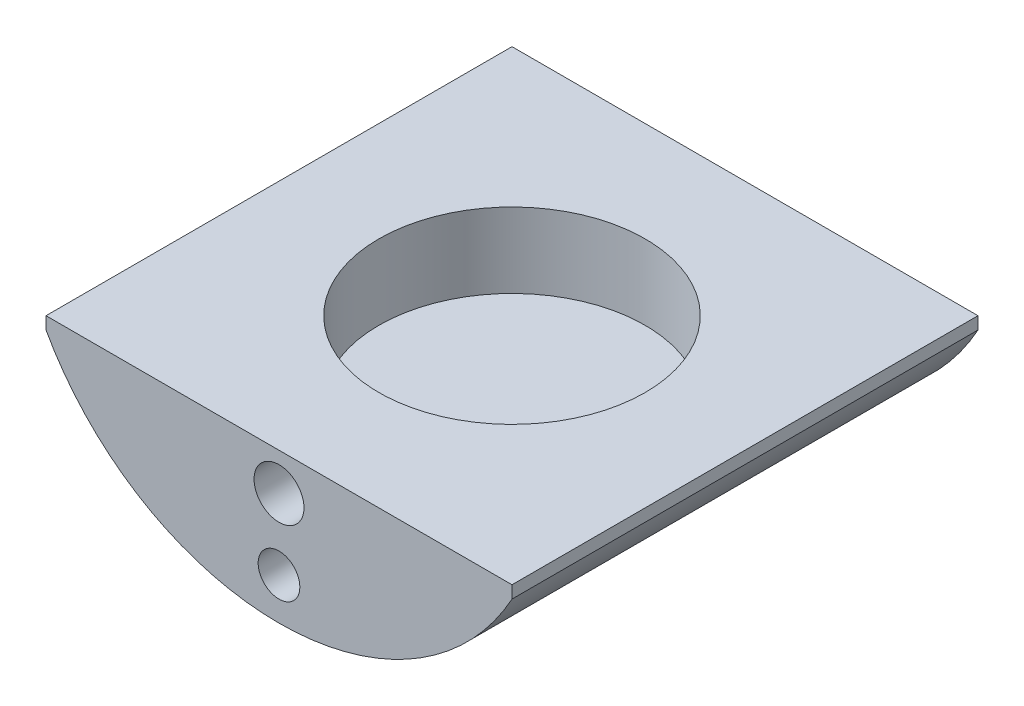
ISO-10303-21;
HEADER;
FILE_DESCRIPTION(('STEP AP214'),'2;1');
FILE_NAME('part.step','',(''),(''),'','','');
FILE_SCHEMA(('AUTOMOTIVE_DESIGN { 1 0 10303 214 1 1 1 1 }'));
ENDSEC;
DATA;
#1=APPLICATION_CONTEXT('core data for automotive mechanical design processes');
#2=APPLICATION_PROTOCOL_DEFINITION('international standard','automotive_design',2000,#1);
#3=PRODUCT_CONTEXT('',#1,'mechanical');
#4=PRODUCT('Part','Part','',(#3));
#5=PRODUCT_RELATED_PRODUCT_CATEGORY('part','',(#4));
#6=PRODUCT_DEFINITION_FORMATION('','',#4);
#7=PRODUCT_DEFINITION_CONTEXT('part definition',#1,'design');
#8=PRODUCT_DEFINITION('design','',#6,#7);
#9=PRODUCT_DEFINITION_SHAPE('','',#8);
#10=(LENGTH_UNIT() NAMED_UNIT(*) SI_UNIT(.MILLI.,.METRE.));
#11=(NAMED_UNIT(*) PLANE_ANGLE_UNIT() SI_UNIT($,.RADIAN.));
#12=(NAMED_UNIT(*) SI_UNIT($,.STERADIAN.) SOLID_ANGLE_UNIT());
#13=UNCERTAINTY_MEASURE_WITH_UNIT(LENGTH_MEASURE(1.E-05),#10,'distance_accuracy_value','');
#14=(GEOMETRIC_REPRESENTATION_CONTEXT(3) GLOBAL_UNCERTAINTY_ASSIGNED_CONTEXT((#13)) GLOBAL_UNIT_ASSIGNED_CONTEXT((#10,
#11,#12)) REPRESENTATION_CONTEXT('',''));
#15=CARTESIAN_POINT('',(0.,0.,0.));
#16=DIRECTION('',(0.,0.,1.));
#17=DIRECTION('',(1.,0.,0.));
#18=AXIS2_PLACEMENT_3D('',#15,#16,#17);
#19=CARTESIAN_POINT('',(0.,22.225,-44.45));
#20=DIRECTION('',(0.,0.,1.));
#21=DIRECTION('',(1.,0.,0.));
#22=AXIS2_PLACEMENT_3D('',#19,#20,#21);
#23=PLANE('',#22);
#24=CARTESIAN_POINT('',(0.,-7.14375,-44.45));
#25=DIRECTION('',(0.,0.,1.));
#26=DIRECTION('',(1.,0.,0.));
#27=AXIS2_PLACEMENT_3D('',#24,#25,#26);
#28=CIRCLE('',#27,4.7625);
#29=CARTESIAN_POINT('',(4.7625,-7.14375,-44.45));
#30=VERTEX_POINT('',#29);
#31=EDGE_CURVE('E119',#30,#30,#28,.T.);
#32=ORIENTED_EDGE('',*,*,#31,.T.);
#33=EDGE_LOOP('',(#32));
#34=FACE_BOUND('',#33,.T.);
#35=DIRECTION('',(0.,-1.,0.));
#36=VECTOR('',#35,1.);
#37=CARTESIAN_POINT('',(-44.45,0.,-44.45));
#38=LINE('',#37,#36);
#39=CARTESIAN_POINT('',(-44.45,0.,-44.45));
#40=VERTEX_POINT('',#39);
#41=CARTESIAN_POINT('',(-44.45,-2.36844424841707,-44.45));
#42=VERTEX_POINT('',#41);
#43=EDGE_CURVE('E71',#40,#42,#38,.T.);
#44=ORIENTED_EDGE('',*,*,#43,.F.);
#45=DIRECTION('',(1.,0.,0.));
#46=VECTOR('',#45,1.);
#47=CARTESIAN_POINT('',(-44.45,0.,-44.45));
#48=LINE('',#47,#46);
#49=CARTESIAN_POINT('',(44.45,0.,-44.45));
#50=VERTEX_POINT('',#49);
#51=EDGE_CURVE('E50',#40,#50,#48,.T.);
#52=ORIENTED_EDGE('',*,*,#51,.T.);
#53=DIRECTION('',(0.,1.,0.));
#54=VECTOR('',#53,1.);
#55=CARTESIAN_POINT('',(44.45,-2.3684442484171,-44.45));
#56=LINE('',#55,#54);
#57=CARTESIAN_POINT('',(44.45,-2.3684442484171,-44.45));
#58=VERTEX_POINT('',#57);
#59=EDGE_CURVE('E100',#58,#50,#56,.T.);
#60=ORIENTED_EDGE('',*,*,#59,.F.);
#61=CARTESIAN_POINT('',(0.,22.225,-44.45));
#62=DIRECTION('',(0.,0.,1.));
#63=DIRECTION('',(1.,0.,0.));
#64=AXIS2_PLACEMENT_3D('',#61,#62,#63);
#65=CIRCLE('',#64,50.8);
#66=EDGE_CURVE('E98',#42,#58,#65,.T.);
#67=ORIENTED_EDGE('',*,*,#66,.F.);
#68=EDGE_LOOP('',(#44,#52,#60,#67));
#69=FACE_BOUND('',#68,.T.);
#70=CARTESIAN_POINT('',(0.,-20.6248,-44.4500000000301));
#71=DIRECTION('',(0.,0.,1.));
#72=DIRECTION('',(1.,0.,0.));
#73=AXIS2_PLACEMENT_3D('',#70,#71,#72);
#74=CIRCLE('',#73,3.9751);
#75=CARTESIAN_POINT('',(3.9751,-20.6248,-44.4500000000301));
#76=VERTEX_POINT('',#75);
#77=EDGE_CURVE('E114',#76,#76,#74,.T.);
#78=ORIENTED_EDGE('',*,*,#77,.T.);
#79=EDGE_LOOP('',(#78));
#80=FACE_BOUND('',#79,.T.);
#81=ADVANCED_FACE('F28',(#34,#69,#80),#23,.F.);
#82=CARTESIAN_POINT('',(-44.45,0.,-44.45));
#83=DIRECTION('',(-1.,0.,0.));
#84=DIRECTION('',(0.,-1.,0.));
#85=AXIS2_PLACEMENT_3D('',#82,#83,#84);
#86=PLANE('',#85);
#87=DIRECTION('',(0.,-1.,0.));
#88=VECTOR('',#87,1.);
#89=CARTESIAN_POINT('',(-44.45,0.,44.45));
#90=LINE('',#89,#88);
#91=CARTESIAN_POINT('',(-44.45,0.,44.45));
#92=VERTEX_POINT('',#91);
#93=CARTESIAN_POINT('',(-44.45,-2.36844424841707,44.45));
#94=VERTEX_POINT('',#93);
#95=EDGE_CURVE('E70',#92,#94,#90,.T.);
#96=ORIENTED_EDGE('',*,*,#95,.F.);
#97=DIRECTION('',(0.,0.,1.));
#98=VECTOR('',#97,1.);
#99=CARTESIAN_POINT('',(-44.45,0.,-44.45));
#100=LINE('',#99,#98);
#101=EDGE_CURVE('E11',#40,#92,#100,.T.);
#102=ORIENTED_EDGE('',*,*,#101,.F.);
#103=ORIENTED_EDGE('',*,*,#43,.T.);
#104=DIRECTION('',(0.,0.,1.));
#105=VECTOR('',#104,1.);
#106=CARTESIAN_POINT('',(-44.45,-2.36844424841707,-44.45));
#107=LINE('',#106,#105);
#108=EDGE_CURVE('E32',#42,#94,#107,.T.);
#109=ORIENTED_EDGE('',*,*,#108,.T.);
#110=EDGE_LOOP('',(#96,#102,#103,#109));
#111=FACE_BOUND('',#110,.T.);
#112=ADVANCED_FACE('F30',(#111),#86,.T.);
#113=CARTESIAN_POINT('',(-44.45,0.,-44.45));
#114=DIRECTION('',(0.,-1.,0.));
#115=DIRECTION('',(1.,0.,0.));
#116=AXIS2_PLACEMENT_3D('',#113,#114,#115);
#117=PLANE('',#116);
#118=CARTESIAN_POINT('',(0.,0.,0.));
#119=DIRECTION('',(0.,1.,0.));
#120=DIRECTION('',(-1.,0.,0.));
#121=AXIS2_PLACEMENT_3D('',#118,#119,#120);
#122=CIRCLE('',#121,25.4);
#123=CARTESIAN_POINT('',(-25.4,0.,0.));
#124=VERTEX_POINT('',#123);
#125=EDGE_CURVE('E91',#124,#124,#122,.T.);
#126=ORIENTED_EDGE('',*,*,#125,.F.);
#127=EDGE_LOOP('',(#126));
#128=FACE_BOUND('',#127,.T.);
#129=DIRECTION('',(1.,0.,0.));
#130=VECTOR('',#129,1.);
#131=CARTESIAN_POINT('',(-44.45,0.,44.45));
#132=LINE('',#131,#130);
#133=CARTESIAN_POINT('',(44.45,0.,44.45));
#134=VERTEX_POINT('',#133);
#135=EDGE_CURVE('E87',#92,#134,#132,.T.);
#136=ORIENTED_EDGE('',*,*,#135,.T.);
#137=DIRECTION('',(0.,0.,1.));
#138=VECTOR('',#137,1.);
#139=CARTESIAN_POINT('',(44.45,0.,-44.45));
#140=LINE('',#139,#138);
#141=EDGE_CURVE('E37',#50,#134,#140,.T.);
#142=ORIENTED_EDGE('',*,*,#141,.F.);
#143=ORIENTED_EDGE('',*,*,#51,.F.);
#144=ORIENTED_EDGE('',*,*,#101,.T.);
#145=EDGE_LOOP('',(#136,#142,#143,#144));
#146=FACE_BOUND('',#145,.T.);
#147=ADVANCED_FACE('F107',(#128,#146),#117,.F.);
#148=CARTESIAN_POINT('',(44.45,-2.3684442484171,-44.45));
#149=DIRECTION('',(1.,0.,0.));
#150=DIRECTION('',(0.,1.,0.));
#151=AXIS2_PLACEMENT_3D('',#148,#149,#150);
#152=PLANE('',#151);
#153=DIRECTION('',(0.,1.,0.));
#154=VECTOR('',#153,1.);
#155=CARTESIAN_POINT('',(44.45,-2.3684442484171,44.45));
#156=LINE('',#155,#154);
#157=CARTESIAN_POINT('',(44.45,-2.3684442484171,44.45));
#158=VERTEX_POINT('',#157);
#159=EDGE_CURVE('E82',#158,#134,#156,.T.);
#160=ORIENTED_EDGE('',*,*,#159,.F.);
#161=DIRECTION('',(0.,0.,1.));
#162=VECTOR('',#161,1.);
#163=CARTESIAN_POINT('',(44.45,-2.3684442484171,-44.45));
#164=LINE('',#163,#162);
#165=EDGE_CURVE('E75',#58,#158,#164,.T.);
#166=ORIENTED_EDGE('',*,*,#165,.F.);
#167=ORIENTED_EDGE('',*,*,#59,.T.);
#168=ORIENTED_EDGE('',*,*,#141,.T.);
#169=EDGE_LOOP('',(#160,#166,#167,#168));
#170=FACE_BOUND('',#169,.T.);
#171=ADVANCED_FACE('F105',(#170),#152,.T.);
#172=CARTESIAN_POINT('',(0.,22.225,-44.45));
#173=DIRECTION('',(0.,0.,1.));
#174=DIRECTION('',(1.,0.,0.));
#175=AXIS2_PLACEMENT_3D('',#172,#173,#174);
#176=CYLINDRICAL_SURFACE('',#175,50.8);
#177=CARTESIAN_POINT('',(0.,22.225,44.45));
#178=DIRECTION('',(0.,0.,1.));
#179=DIRECTION('',(1.,0.,0.));
#180=AXIS2_PLACEMENT_3D('',#177,#178,#179);
#181=CIRCLE('',#180,50.8);
#182=EDGE_CURVE('E77',#94,#158,#181,.T.);
#183=ORIENTED_EDGE('',*,*,#182,.F.);
#184=ORIENTED_EDGE('',*,*,#108,.F.);
#185=ORIENTED_EDGE('',*,*,#66,.T.);
#186=ORIENTED_EDGE('',*,*,#165,.T.);
#187=EDGE_LOOP('',(#183,#184,#185,#186));
#188=FACE_BOUND('',#187,.T.);
#189=ADVANCED_FACE('F78',(#188),#176,.T.);
#190=CARTESIAN_POINT('',(0.,22.225,44.45));
#191=DIRECTION('',(0.,0.,1.));
#192=DIRECTION('',(1.,0.,0.));
#193=AXIS2_PLACEMENT_3D('',#190,#191,#192);
#194=PLANE('',#193);
#195=CARTESIAN_POINT('',(0.,-20.6248,44.4500000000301));
#196=DIRECTION('',(0.,0.,1.));
#197=DIRECTION('',(1.,0.,0.));
#198=AXIS2_PLACEMENT_3D('',#195,#196,#197);
#199=CIRCLE('',#198,3.9751);
#200=CARTESIAN_POINT('',(3.9751,-20.6248,44.4500000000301));
#201=VERTEX_POINT('',#200);
#202=EDGE_CURVE('E127',#201,#201,#199,.T.);
#203=ORIENTED_EDGE('',*,*,#202,.F.);
#204=EDGE_LOOP('',(#203));
#205=FACE_BOUND('',#204,.T.);
#206=CARTESIAN_POINT('',(0.,-7.14375,44.45));
#207=DIRECTION('',(0.,0.,1.));
#208=DIRECTION('',(1.,0.,0.));
#209=AXIS2_PLACEMENT_3D('',#206,#207,#208);
#210=CIRCLE('',#209,4.7625);
#211=CARTESIAN_POINT('',(4.7625,-7.14375,44.45));
#212=VERTEX_POINT('',#211);
#213=EDGE_CURVE('E133',#212,#212,#210,.T.);
#214=ORIENTED_EDGE('',*,*,#213,.F.);
#215=EDGE_LOOP('',(#214));
#216=FACE_BOUND('',#215,.T.);
#217=ORIENTED_EDGE('',*,*,#95,.T.);
#218=ORIENTED_EDGE('',*,*,#182,.T.);
#219=ORIENTED_EDGE('',*,*,#159,.T.);
#220=ORIENTED_EDGE('',*,*,#135,.F.);
#221=EDGE_LOOP('',(#217,#218,#219,#220));
#222=FACE_BOUND('',#221,.T.);
#223=ADVANCED_FACE('F85',(#205,#216,#222),#194,.T.);
#224=CARTESIAN_POINT('',(0.,-14.2875,0.));
#225=DIRECTION('',(0.,1.,0.));
#226=DIRECTION('',(-1.,0.,0.));
#227=AXIS2_PLACEMENT_3D('',#224,#225,#226);
#228=CYLINDRICAL_SURFACE('',#227,25.4);
#229=CARTESIAN_POINT('',(0.,-14.2875,0.));
#230=DIRECTION('',(0.,1.,0.));
#231=DIRECTION('',(-1.,0.,0.));
#232=AXIS2_PLACEMENT_3D('',#229,#230,#231);
#233=CIRCLE('',#232,25.4);
#234=CARTESIAN_POINT('',(-25.4,-14.2875,0.));
#235=VERTEX_POINT('',#234);
#236=EDGE_CURVE('E88',#235,#235,#233,.T.);
#237=ORIENTED_EDGE('',*,*,#236,.F.);
#238=EDGE_LOOP('',(#237));
#239=FACE_BOUND('',#238,.T.);
#240=ORIENTED_EDGE('',*,*,#125,.T.);
#241=EDGE_LOOP('',(#240));
#242=FACE_BOUND('',#241,.T.);
#243=ADVANCED_FACE('F141',(#239,#242),#228,.F.);
#244=CARTESIAN_POINT('',(0.,-14.2875,0.));
#245=DIRECTION('',(0.,1.,0.));
#246=DIRECTION('',(-1.,0.,0.));
#247=AXIS2_PLACEMENT_3D('',#244,#245,#246);
#248=PLANE('',#247);
#249=ORIENTED_EDGE('',*,*,#236,.T.);
#250=EDGE_LOOP('',(#249));
#251=FACE_BOUND('',#250,.T.);
#252=ADVANCED_FACE('F161',(#251),#248,.T.);
#253=CARTESIAN_POINT('',(0.,-7.14375,30.1625));
#254=DIRECTION('',(0.,0.,1.));
#255=DIRECTION('',(1.,0.,0.));
#256=AXIS2_PLACEMENT_3D('',#253,#254,#255);
#257=CYLINDRICAL_SURFACE('',#256,4.7625);
#258=CARTESIAN_POINT('',(0.,-7.14375,30.1625));
#259=DIRECTION('',(0.,0.,1.));
#260=DIRECTION('',(1.,0.,0.));
#261=AXIS2_PLACEMENT_3D('',#258,#259,#260);
#262=CIRCLE('',#261,4.7625);
#263=CARTESIAN_POINT('',(4.7625,-7.14375,30.1625));
#264=VERTEX_POINT('',#263);
#265=EDGE_CURVE('E136',#264,#264,#262,.T.);
#266=ORIENTED_EDGE('',*,*,#265,.F.);
#267=EDGE_LOOP('',(#266));
#268=FACE_BOUND('',#267,.T.);
#269=ORIENTED_EDGE('',*,*,#213,.T.);
#270=EDGE_LOOP('',(#269));
#271=FACE_BOUND('',#270,.T.);
#272=ADVANCED_FACE('F169',(#268,#271),#257,.F.);
#273=CARTESIAN_POINT('',(0.,-7.14375,30.1625));
#274=DIRECTION('',(0.,0.,1.));
#275=DIRECTION('',(1.,0.,0.));
#276=AXIS2_PLACEMENT_3D('',#273,#274,#275);
#277=PLANE('',#276);
#278=ORIENTED_EDGE('',*,*,#265,.T.);
#279=EDGE_LOOP('',(#278));
#280=FACE_BOUND('',#279,.T.);
#281=ADVANCED_FACE('F173',(#280),#277,.T.);
#282=CARTESIAN_POINT('',(0.,-20.6248,26.9875000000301));
#283=DIRECTION('',(0.,0.,1.));
#284=DIRECTION('',(1.,0.,0.));
#285=AXIS2_PLACEMENT_3D('',#282,#283,#284);
#286=CYLINDRICAL_SURFACE('',#285,3.9751);
#287=CARTESIAN_POINT('',(0.,-20.6248,26.9875000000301));
#288=DIRECTION('',(0.,0.,1.));
#289=DIRECTION('',(1.,0.,0.));
#290=AXIS2_PLACEMENT_3D('',#287,#288,#289);
#291=CIRCLE('',#290,3.9751);
#292=CARTESIAN_POINT('',(3.9751,-20.6248,26.9875000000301));
#293=VERTEX_POINT('',#292);
#294=EDGE_CURVE('E130',#293,#293,#291,.T.);
#295=ORIENTED_EDGE('',*,*,#294,.F.);
#296=EDGE_LOOP('',(#295));
#297=FACE_BOUND('',#296,.T.);
#298=ORIENTED_EDGE('',*,*,#202,.T.);
#299=EDGE_LOOP('',(#298));
#300=FACE_BOUND('',#299,.T.);
#301=ADVANCED_FACE('F176',(#297,#300),#286,.F.);
#302=CARTESIAN_POINT('',(0.,-20.6248,26.9875000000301));
#303=DIRECTION('',(0.,0.,1.));
#304=DIRECTION('',(1.,0.,0.));
#305=AXIS2_PLACEMENT_3D('',#302,#303,#304);
#306=PLANE('',#305);
#307=ORIENTED_EDGE('',*,*,#294,.T.);
#308=EDGE_LOOP('',(#307));
#309=FACE_BOUND('',#308,.T.);
#310=ADVANCED_FACE('F179',(#309),#306,.T.);
#311=CARTESIAN_POINT('',(0.,-7.14375,-30.1625));
#312=DIRECTION('',(0.,0.,-1.));
#313=DIRECTION('',(-1.,0.,0.));
#314=AXIS2_PLACEMENT_3D('',#311,#312,#313);
#315=CYLINDRICAL_SURFACE('',#314,4.7625);
#316=CARTESIAN_POINT('',(0.,-7.14375,-30.1625));
#317=DIRECTION('',(0.,0.,1.));
#318=DIRECTION('',(1.,0.,0.));
#319=AXIS2_PLACEMENT_3D('',#316,#317,#318);
#320=CIRCLE('',#319,4.7625);
#321=CARTESIAN_POINT('',(4.7625,-7.14375,-30.1625));
#322=VERTEX_POINT('',#321);
#323=EDGE_CURVE('E124',#322,#322,#320,.T.);
#324=ORIENTED_EDGE('',*,*,#323,.T.);
#325=EDGE_LOOP('',(#324));
#326=FACE_BOUND('',#325,.T.);
#327=ORIENTED_EDGE('',*,*,#31,.F.);
#328=EDGE_LOOP('',(#327));
#329=FACE_BOUND('',#328,.T.);
#330=ADVANCED_FACE('F183',(#326,#329),#315,.F.);
#331=CARTESIAN_POINT('',(0.,-7.14375,-30.1625));
#332=DIRECTION('',(0.,0.,-1.));
#333=DIRECTION('',(1.,0.,0.));
#334=AXIS2_PLACEMENT_3D('',#331,#332,#333);
#335=PLANE('',#334);
#336=ORIENTED_EDGE('',*,*,#323,.F.);
#337=EDGE_LOOP('',(#336));
#338=FACE_BOUND('',#337,.T.);
#339=ADVANCED_FACE('F187',(#338),#335,.T.);
#340=CARTESIAN_POINT('',(0.,-20.6248,-26.9875000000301));
#341=DIRECTION('',(0.,0.,-1.));
#342=DIRECTION('',(-1.,0.,0.));
#343=AXIS2_PLACEMENT_3D('',#340,#341,#342);
#344=CYLINDRICAL_SURFACE('',#343,3.9751);
#345=CARTESIAN_POINT('',(0.,-20.6248,-26.9875000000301));
#346=DIRECTION('',(0.,0.,1.));
#347=DIRECTION('',(1.,0.,0.));
#348=AXIS2_PLACEMENT_3D('',#345,#346,#347);
#349=CIRCLE('',#348,3.9751);
#350=CARTESIAN_POINT('',(3.9751,-20.6248,-26.9875000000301));
#351=VERTEX_POINT('',#350);
#352=EDGE_CURVE('E116',#351,#351,#349,.T.);
#353=ORIENTED_EDGE('',*,*,#352,.T.);
#354=EDGE_LOOP('',(#353));
#355=FACE_BOUND('',#354,.T.);
#356=ORIENTED_EDGE('',*,*,#77,.F.);
#357=EDGE_LOOP('',(#356));
#358=FACE_BOUND('',#357,.T.);
#359=ADVANCED_FACE('F191',(#355,#358),#344,.F.);
#360=CARTESIAN_POINT('',(0.,-20.6248,-26.9875000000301));
#361=DIRECTION('',(0.,0.,-1.));
#362=DIRECTION('',(1.,0.,0.));
#363=AXIS2_PLACEMENT_3D('',#360,#361,#362);
#364=PLANE('',#363);
#365=ORIENTED_EDGE('',*,*,#352,.F.);
#366=EDGE_LOOP('',(#365));
#367=FACE_BOUND('',#366,.T.);
#368=ADVANCED_FACE('F195',(#367),#364,.T.);
#369=CLOSED_SHELL('',(#81,#112,#147,#171,#189,#223,#243,#252,#272,#281,#301,#310,#330,#339,#359,#368));
#370=MANIFOLD_SOLID_BREP('B2',#369);
#371=ADVANCED_BREP_SHAPE_REPRESENTATION('',(#18,#370),#14);
#372=SHAPE_DEFINITION_REPRESENTATION(#9,#371);
ENDSEC;
END-ISO-10303-21;
